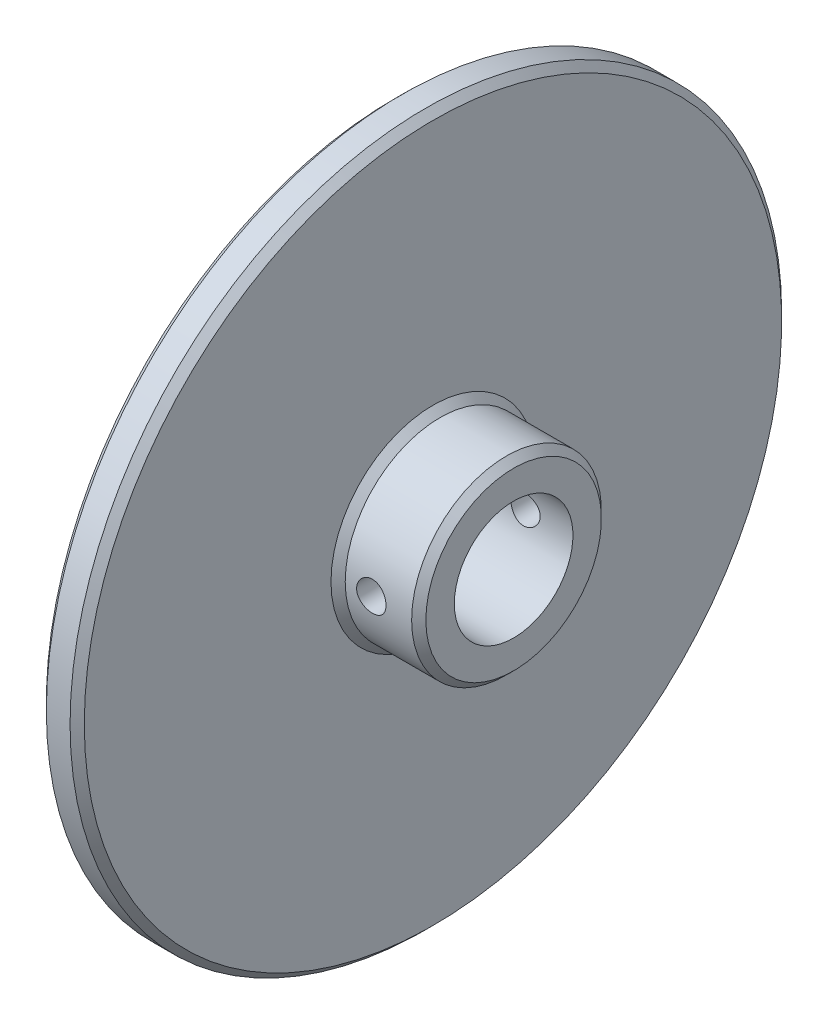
ISO-10303-21;
HEADER;
FILE_DESCRIPTION(('STEP AP214'),'2;1');
FILE_NAME('part.step','',(''),(''),'','','');
FILE_SCHEMA(('AUTOMOTIVE_DESIGN { 1 0 10303 214 1 1 1 1 }'));
ENDSEC;
DATA;
#1=APPLICATION_CONTEXT('core data for automotive mechanical design processes');
#2=APPLICATION_PROTOCOL_DEFINITION('international standard','automotive_design',2000,#1);
#3=PRODUCT_CONTEXT('',#1,'mechanical');
#4=PRODUCT('Part','Part','',(#3));
#5=PRODUCT_RELATED_PRODUCT_CATEGORY('part','',(#4));
#6=PRODUCT_DEFINITION_FORMATION('','',#4);
#7=PRODUCT_DEFINITION_CONTEXT('part definition',#1,'design');
#8=PRODUCT_DEFINITION('design','',#6,#7);
#9=PRODUCT_DEFINITION_SHAPE('','',#8);
#10=(LENGTH_UNIT() NAMED_UNIT(*) SI_UNIT(.MILLI.,.METRE.));
#11=(NAMED_UNIT(*) PLANE_ANGLE_UNIT() SI_UNIT($,.RADIAN.));
#12=(NAMED_UNIT(*) SI_UNIT($,.STERADIAN.) SOLID_ANGLE_UNIT());
#13=UNCERTAINTY_MEASURE_WITH_UNIT(LENGTH_MEASURE(1.E-05),#10,'distance_accuracy_value','');
#14=(GEOMETRIC_REPRESENTATION_CONTEXT(3) GLOBAL_UNCERTAINTY_ASSIGNED_CONTEXT((#13)) GLOBAL_UNIT_ASSIGNED_CONTEXT((#10,
#11,#12)) REPRESENTATION_CONTEXT('',''));
#15=CARTESIAN_POINT('',(0.,0.,0.));
#16=DIRECTION('',(0.,0.,1.));
#17=DIRECTION('',(1.,0.,0.));
#18=AXIS2_PLACEMENT_3D('',#15,#16,#17);
#19=CARTESIAN_POINT('',(0.,75.,0.));
#20=DIRECTION('',(1.,0.,0.));
#21=DIRECTION('',(0.,0.,-1.));
#22=AXIS2_PLACEMENT_3D('',#19,#20,#21);
#23=PLANE('',#22);
#24=CARTESIAN_POINT('',(0.,0.,0.));
#25=DIRECTION('',(1.,0.,0.));
#26=DIRECTION('',(0.,0.,-1.));
#27=AXIS2_PLACEMENT_3D('',#24,#25,#26);
#28=CIRCLE('',#27,14.);
#29=CARTESIAN_POINT('',(0.,0.,-14.));
#30=VERTEX_POINT('',#29);
#31=EDGE_CURVE('E131',#30,#30,#28,.T.);
#32=ORIENTED_EDGE('',*,*,#31,.T.);
#33=EDGE_LOOP('',(#32));
#34=FACE_BOUND('',#33,.T.);
#35=CARTESIAN_POINT('',(0.,0.,0.));
#36=DIRECTION('',(1.,0.,0.));
#37=DIRECTION('',(0.,0.,-1.));
#38=AXIS2_PLACEMENT_3D('',#35,#36,#37);
#39=CIRCLE('',#38,73.5000000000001);
#40=CARTESIAN_POINT('',(0.,0.,-73.5000000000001));
#41=VERTEX_POINT('',#40);
#42=EDGE_CURVE('E128',#41,#41,#39,.F.);
#43=ORIENTED_EDGE('',*,*,#42,.T.);
#44=EDGE_LOOP('',(#43));
#45=FACE_BOUND('',#44,.T.);
#46=ADVANCED_FACE('F30',(#34,#45),#23,.F.);
#47=CARTESIAN_POINT('',(-43.7052848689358,0.,0.));
#48=DIRECTION('',(-1.,0.,0.));
#49=DIRECTION('',(0.,0.,1.));
#50=AXIS2_PLACEMENT_3D('',#47,#48,#49);
#51=CYLINDRICAL_SURFACE('',#50,12.5);
#52=CARTESIAN_POINT('',(18.1,0.,12.5));
#53=CARTESIAN_POINT('',(18.0999951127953,0.171321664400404,12.4999970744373));
#54=CARTESIAN_POINT('',(18.0857500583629,0.342698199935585,12.4964427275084));
#55=CARTESIAN_POINT('',(18.0292297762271,0.68054256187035,12.4826080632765));
#56=CARTESIAN_POINT('',(17.9869383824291,0.847007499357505,12.4723238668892));
#57=CARTESIAN_POINT('',(17.8757635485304,1.17010085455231,12.4461687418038));
#58=CARTESIAN_POINT('',(17.8069117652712,1.32674072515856,12.4303044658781));
#59=CARTESIAN_POINT('',(17.6446812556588,1.62624649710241,12.394680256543));
#60=CARTESIAN_POINT('',(17.5513017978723,1.76911198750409,12.3749202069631));
#61=CARTESIAN_POINT('',(17.340664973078,2.03991290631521,12.3332026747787));
#62=CARTESIAN_POINT('',(17.223003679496,2.1675290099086,12.3112117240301));
#63=CARTESIAN_POINT('',(16.9680081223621,2.40143368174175,12.2677341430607));
#64=CARTESIAN_POINT('',(16.8306716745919,2.50771987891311,12.2462475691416));
#65=CARTESIAN_POINT('',(16.5377528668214,2.69744315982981,12.205874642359));
#66=CARTESIAN_POINT('',(16.3819335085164,2.78052420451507,12.1870308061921));
#67=CARTESIAN_POINT('',(16.0579973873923,2.91918958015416,12.1545645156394));
#68=CARTESIAN_POINT('',(15.8898825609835,2.97477823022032,12.1409412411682));
#69=CARTESIAN_POINT('',(15.5496358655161,3.05579378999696,12.1208023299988));
#70=CARTESIAN_POINT('',(15.3776487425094,3.08179427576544,12.114151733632));
#71=CARTESIAN_POINT('',(15.031635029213,3.10468184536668,12.1083071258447));
#72=CARTESIAN_POINT('',(14.8576087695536,3.10157358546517,12.1091119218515));
#73=CARTESIAN_POINT('',(14.5168436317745,3.06678979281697,12.1179657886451));
#74=CARTESIAN_POINT('',(14.3500299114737,3.03579655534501,12.1258418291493));
#75=CARTESIAN_POINT('',(14.0240467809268,2.9472104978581,12.1476751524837));
#76=CARTESIAN_POINT('',(13.864877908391,2.88961580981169,12.1616328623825));
#77=CARTESIAN_POINT('',(13.5568671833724,2.74887729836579,12.1942164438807));
#78=CARTESIAN_POINT('',(13.4081438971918,2.66548486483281,12.212887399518));
#79=CARTESIAN_POINT('',(13.1265566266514,2.47569199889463,12.2527681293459));
#80=CARTESIAN_POINT('',(12.9936953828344,2.36928759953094,12.2739783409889));
#81=CARTESIAN_POINT('',(12.7436923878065,2.13295176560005,12.3172772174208));
#82=CARTESIAN_POINT('',(12.6270959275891,2.00244425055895,12.3393738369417));
#83=CARTESIAN_POINT('',(12.4173412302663,1.72346462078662,12.3814190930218));
#84=CARTESIAN_POINT('',(12.3241836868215,1.57499197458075,12.4013676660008));
#85=CARTESIAN_POINT('',(12.1637555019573,1.26352628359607,12.436965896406));
#86=CARTESIAN_POINT('',(12.096572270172,1.10048644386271,12.4526009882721));
#87=CARTESIAN_POINT('',(11.99071814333,0.764953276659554,12.4777045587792));
#88=CARTESIAN_POINT('',(11.9520418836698,0.59246173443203,12.4871741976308));
#89=CARTESIAN_POINT('',(11.9051296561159,0.247584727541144,12.4987086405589));
#90=CARTESIAN_POINT('',(11.8961509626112,0.0753061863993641,12.5009540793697));
#91=CARTESIAN_POINT('',(11.9068532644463,-0.268291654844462,12.4983010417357));
#92=CARTESIAN_POINT('',(11.9265317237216,-0.439611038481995,12.4934031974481));
#93=CARTESIAN_POINT('',(11.9933772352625,-0.773854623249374,12.4771295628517));
#94=CARTESIAN_POINT('',(12.0401401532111,-0.936864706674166,12.4658490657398));
#95=CARTESIAN_POINT('',(12.1593664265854,-1.25271883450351,12.4380808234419));
#96=CARTESIAN_POINT('',(12.231832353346,-1.40556185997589,12.4215925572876));
#97=CARTESIAN_POINT('',(12.4018542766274,-1.69970617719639,12.3848041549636));
#98=CARTESIAN_POINT('',(12.4998276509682,-1.84075831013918,12.3644422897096));
#99=CARTESIAN_POINT('',(12.7175488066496,-2.10468362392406,12.3222644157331));
#100=CARTESIAN_POINT('',(12.8373002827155,-2.22755371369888,12.3004481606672));
#101=CARTESIAN_POINT('',(13.0986244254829,-2.45467959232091,12.2571718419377));
#102=CARTESIAN_POINT('',(13.2406538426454,-2.55841478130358,12.2357330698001));
#103=CARTESIAN_POINT('',(13.5405439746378,-2.74057686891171,12.1962272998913));
#104=CARTESIAN_POINT('',(13.698403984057,-2.8190048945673,12.1781601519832));
#105=CARTESIAN_POINT('',(14.0246239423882,-2.9477445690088,12.1476409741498));
#106=CARTESIAN_POINT('',(14.1929148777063,-2.99822281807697,12.1351557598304));
#107=CARTESIAN_POINT('',(14.5359507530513,-3.07007327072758,12.1171798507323));
#108=CARTESIAN_POINT('',(14.710694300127,-3.09145171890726,12.1116876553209));
#109=CARTESIAN_POINT('',(15.0563809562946,-3.10417336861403,12.108432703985));
#110=CARTESIAN_POINT('',(15.2272919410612,-3.09634814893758,12.1104559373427));
#111=CARTESIAN_POINT('',(15.5652759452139,-3.05278480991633,12.1215098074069));
#112=CARTESIAN_POINT('',(15.7323490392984,-3.01704723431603,12.1305403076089));
#113=CARTESIAN_POINT('',(16.0570269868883,-2.91912445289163,12.1544728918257));
#114=CARTESIAN_POINT('',(16.2146808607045,-2.85709286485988,12.1693408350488));
#115=CARTESIAN_POINT('',(16.5174551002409,-2.70846488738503,12.2032783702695));
#116=CARTESIAN_POINT('',(16.66257375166,-2.62186514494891,12.2223485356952));
#117=CARTESIAN_POINT('',(16.9401821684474,-2.42394187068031,12.2631540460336));
#118=CARTESIAN_POINT('',(17.072251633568,-2.31204024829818,12.2849452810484));
#119=CARTESIAN_POINT('',(17.3160088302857,-2.06781935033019,12.3284012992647));
#120=CARTESIAN_POINT('',(17.4276917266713,-1.93549524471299,12.3500660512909));
#121=CARTESIAN_POINT('',(17.6294356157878,-1.65135189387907,12.3912866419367));
#122=CARTESIAN_POINT('',(17.7190778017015,-1.49922839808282,12.4107982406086));
#123=CARTESIAN_POINT('',(17.8713737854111,-1.18160190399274,12.4450491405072));
#124=CARTESIAN_POINT('',(17.9340471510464,-1.01610871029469,12.4597918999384));
#125=CARTESIAN_POINT('',(18.0211947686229,-0.709064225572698,12.4806334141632));
#126=CARTESIAN_POINT('',(18.0506833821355,-0.568990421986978,12.4878463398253));
#127=CARTESIAN_POINT('',(18.0900873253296,-0.285957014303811,12.4975306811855));
#128=CARTESIAN_POINT('',(18.1000040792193,-0.142997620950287,12.5000024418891));
#129=CARTESIAN_POINT('',(18.1,0.,12.5));
#130=B_SPLINE_CURVE_WITH_KNOTS('',3,(#52,#53,#54,#55,#56,#57,#58,#59,#60,#61,#62,#63,#64,#65,
#66,#67,#68,#69,#70,#71,#72,#73,#74,#75,#76,#77,#78,#79,#80,#81,#82,#83,#84,#85,#86,#87,#88,#89,
#90,#91,#92,#93,#94,#95,#96,#97,#98,#99,#100,#101,#102,#103,#104,#105,#106,#107,#108,#109,#110,
#111,#112,#113,#114,#115,#116,#117,#118,#119,#120,#121,#122,#123,#124,#125,#126,#127,#128,#129),
.UNSPECIFIED.,.T.,.F.,(4,2,2,2,2,2,2,2,2,2,2,2,2,2,2,2,2,2,2,2,2,2,2,2,2,2,2,2,2,2,2,2,2,2,2,2,
2,2,4),(0.,0.513441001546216,1.02717821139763,1.54030498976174,2.05344707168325,
2.57593534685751,3.09848167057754,3.628652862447,4.15874073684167,4.67836762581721,
5.1979113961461,5.70507856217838,6.2122813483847,6.72453284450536,7.23687271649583,
7.7635798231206,8.29030251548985,8.81878263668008,9.34716328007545,9.86222518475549,
10.3772415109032,10.8847641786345,11.3923376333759,11.9088047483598,12.4253595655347,
12.9543766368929,13.4833701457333,14.0091755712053,14.5348681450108,15.0457072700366,
15.5565364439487,16.0644214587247,16.5723758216,17.093381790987,17.6145111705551,
18.1448871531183,18.6748776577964,19.103464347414,19.532019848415),.UNSPECIFIED.);
#131=CARTESIAN_POINT('',(18.1,0.,12.5));
#132=VERTEX_POINT('',#131);
#133=EDGE_CURVE('E75',#132,#132,#130,.T.);
#134=ORIENTED_EDGE('',*,*,#133,.T.);
#135=EDGE_LOOP('',(#134));
#136=FACE_BOUND('',#135,.T.);
#137=CARTESIAN_POINT('',(18.1,0.,-12.5));
#138=CARTESIAN_POINT('',(18.0999951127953,-0.171321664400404,-12.4999970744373));
#139=CARTESIAN_POINT('',(18.0857500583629,-0.342698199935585,-12.4964427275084));
#140=CARTESIAN_POINT('',(18.0292297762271,-0.68054256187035,-12.4826080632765));
#141=CARTESIAN_POINT('',(17.9869383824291,-0.847007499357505,-12.4723238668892));
#142=CARTESIAN_POINT('',(17.8757635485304,-1.17010085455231,-12.4461687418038));
#143=CARTESIAN_POINT('',(17.8069117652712,-1.32674072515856,-12.4303044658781));
#144=CARTESIAN_POINT('',(17.6446812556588,-1.62624649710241,-12.394680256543));
#145=CARTESIAN_POINT('',(17.5513017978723,-1.76911198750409,-12.3749202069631));
#146=CARTESIAN_POINT('',(17.340664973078,-2.03991290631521,-12.3332026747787));
#147=CARTESIAN_POINT('',(17.223003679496,-2.1675290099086,-12.3112117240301));
#148=CARTESIAN_POINT('',(16.9680081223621,-2.40143368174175,-12.2677341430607));
#149=CARTESIAN_POINT('',(16.8306716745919,-2.50771987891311,-12.2462475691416));
#150=CARTESIAN_POINT('',(16.5377528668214,-2.69744315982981,-12.205874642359));
#151=CARTESIAN_POINT('',(16.3819335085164,-2.78052420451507,-12.1870308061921));
#152=CARTESIAN_POINT('',(16.0579973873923,-2.91918958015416,-12.1545645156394));
#153=CARTESIAN_POINT('',(15.8898825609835,-2.97477823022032,-12.1409412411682));
#154=CARTESIAN_POINT('',(15.5496358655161,-3.05579378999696,-12.1208023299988));
#155=CARTESIAN_POINT('',(15.3776487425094,-3.08179427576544,-12.114151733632));
#156=CARTESIAN_POINT('',(15.031635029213,-3.10468184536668,-12.1083071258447));
#157=CARTESIAN_POINT('',(14.8576087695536,-3.10157358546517,-12.1091119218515));
#158=CARTESIAN_POINT('',(14.5168436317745,-3.06678979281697,-12.1179657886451));
#159=CARTESIAN_POINT('',(14.3500299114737,-3.03579655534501,-12.1258418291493));
#160=CARTESIAN_POINT('',(14.0240467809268,-2.9472104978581,-12.1476751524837));
#161=CARTESIAN_POINT('',(13.864877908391,-2.88961580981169,-12.1616328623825));
#162=CARTESIAN_POINT('',(13.5568671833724,-2.74887729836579,-12.1942164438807));
#163=CARTESIAN_POINT('',(13.4081438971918,-2.66548486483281,-12.212887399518));
#164=CARTESIAN_POINT('',(13.1265566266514,-2.47569199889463,-12.2527681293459));
#165=CARTESIAN_POINT('',(12.9936953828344,-2.36928759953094,-12.2739783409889));
#166=CARTESIAN_POINT('',(12.7436923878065,-2.13295176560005,-12.3172772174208));
#167=CARTESIAN_POINT('',(12.6270959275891,-2.00244425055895,-12.3393738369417));
#168=CARTESIAN_POINT('',(12.4173412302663,-1.72346462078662,-12.3814190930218));
#169=CARTESIAN_POINT('',(12.3241836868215,-1.57499197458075,-12.4013676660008));
#170=CARTESIAN_POINT('',(12.1637555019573,-1.26352628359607,-12.436965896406));
#171=CARTESIAN_POINT('',(12.096572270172,-1.10048644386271,-12.4526009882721));
#172=CARTESIAN_POINT('',(11.99071814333,-0.764953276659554,-12.4777045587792));
#173=CARTESIAN_POINT('',(11.9520418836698,-0.59246173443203,-12.4871741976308));
#174=CARTESIAN_POINT('',(11.9051296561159,-0.247584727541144,-12.4987086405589));
#175=CARTESIAN_POINT('',(11.8961509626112,-0.0753061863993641,-12.5009540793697));
#176=CARTESIAN_POINT('',(11.9068532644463,0.268291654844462,-12.4983010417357));
#177=CARTESIAN_POINT('',(11.9265317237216,0.439611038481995,-12.4934031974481));
#178=CARTESIAN_POINT('',(11.9933772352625,0.773854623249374,-12.4771295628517));
#179=CARTESIAN_POINT('',(12.0401401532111,0.936864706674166,-12.4658490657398));
#180=CARTESIAN_POINT('',(12.1593664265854,1.25271883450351,-12.4380808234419));
#181=CARTESIAN_POINT('',(12.231832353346,1.40556185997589,-12.4215925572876));
#182=CARTESIAN_POINT('',(12.4018542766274,1.69970617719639,-12.3848041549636));
#183=CARTESIAN_POINT('',(12.4998276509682,1.84075831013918,-12.3644422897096));
#184=CARTESIAN_POINT('',(12.7175488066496,2.10468362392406,-12.3222644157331));
#185=CARTESIAN_POINT('',(12.8373002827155,2.22755371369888,-12.3004481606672));
#186=CARTESIAN_POINT('',(13.0986244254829,2.45467959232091,-12.2571718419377));
#187=CARTESIAN_POINT('',(13.2406538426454,2.55841478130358,-12.2357330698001));
#188=CARTESIAN_POINT('',(13.5405439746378,2.74057686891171,-12.1962272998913));
#189=CARTESIAN_POINT('',(13.698403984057,2.8190048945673,-12.1781601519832));
#190=CARTESIAN_POINT('',(14.0246239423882,2.9477445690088,-12.1476409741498));
#191=CARTESIAN_POINT('',(14.1929148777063,2.99822281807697,-12.1351557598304));
#192=CARTESIAN_POINT('',(14.5359507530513,3.07007327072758,-12.1171798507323));
#193=CARTESIAN_POINT('',(14.710694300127,3.09145171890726,-12.1116876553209));
#194=CARTESIAN_POINT('',(15.0563809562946,3.10417336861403,-12.108432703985));
#195=CARTESIAN_POINT('',(15.2272919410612,3.09634814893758,-12.1104559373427));
#196=CARTESIAN_POINT('',(15.5652759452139,3.05278480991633,-12.1215098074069));
#197=CARTESIAN_POINT('',(15.7323490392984,3.01704723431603,-12.1305403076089));
#198=CARTESIAN_POINT('',(16.0570269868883,2.91912445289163,-12.1544728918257));
#199=CARTESIAN_POINT('',(16.2146808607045,2.85709286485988,-12.1693408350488));
#200=CARTESIAN_POINT('',(16.5174551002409,2.70846488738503,-12.2032783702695));
#201=CARTESIAN_POINT('',(16.66257375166,2.62186514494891,-12.2223485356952));
#202=CARTESIAN_POINT('',(16.9401821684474,2.42394187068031,-12.2631540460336));
#203=CARTESIAN_POINT('',(17.072251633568,2.31204024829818,-12.2849452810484));
#204=CARTESIAN_POINT('',(17.3160088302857,2.06781935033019,-12.3284012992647));
#205=CARTESIAN_POINT('',(17.4276917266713,1.93549524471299,-12.3500660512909));
#206=CARTESIAN_POINT('',(17.6294356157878,1.65135189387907,-12.3912866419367));
#207=CARTESIAN_POINT('',(17.7190778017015,1.49922839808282,-12.4107982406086));
#208=CARTESIAN_POINT('',(17.8713737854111,1.18160190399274,-12.4450491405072));
#209=CARTESIAN_POINT('',(17.9340471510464,1.01610871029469,-12.4597918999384));
#210=CARTESIAN_POINT('',(18.0211947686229,0.709064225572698,-12.4806334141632));
#211=CARTESIAN_POINT('',(18.0506833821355,0.568990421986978,-12.4878463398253));
#212=CARTESIAN_POINT('',(18.0900873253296,0.285957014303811,-12.4975306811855));
#213=CARTESIAN_POINT('',(18.1000040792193,0.142997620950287,-12.5000024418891));
#214=CARTESIAN_POINT('',(18.1,0.,-12.5));
#215=B_SPLINE_CURVE_WITH_KNOTS('',3,(#137,#138,#139,#140,#141,#142,#143,#144,#145,#146,#147,
#148,#149,#150,#151,#152,#153,#154,#155,#156,#157,#158,#159,#160,#161,#162,#163,#164,#165,#166,
#167,#168,#169,#170,#171,#172,#173,#174,#175,#176,#177,#178,#179,#180,#181,#182,#183,#184,#185,
#186,#187,#188,#189,#190,#191,#192,#193,#194,#195,#196,#197,#198,#199,#200,#201,#202,#203,#204,
#205,#206,#207,#208,#209,#210,#211,#212,#213,#214),.UNSPECIFIED.,.T.,.F.,(4,2,2,2,2,2,2,2,2,2,2,
2,2,2,2,2,2,2,2,2,2,2,2,2,2,2,2,2,2,2,2,2,2,2,2,2,2,2,4),(0.,0.513441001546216,1.02717821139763,
1.54030498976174,2.05344707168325,2.57593534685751,3.09848167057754,3.628652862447,
4.15874073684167,4.67836762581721,5.1979113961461,5.70507856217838,6.2122813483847,
6.72453284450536,7.23687271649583,7.7635798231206,8.29030251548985,8.81878263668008,
9.34716328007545,9.86222518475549,10.3772415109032,10.8847641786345,11.3923376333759,
11.9088047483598,12.4253595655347,12.9543766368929,13.4833701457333,14.0091755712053,
14.5348681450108,15.0457072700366,15.5565364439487,16.0644214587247,16.5723758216,
17.093381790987,17.6145111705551,18.1448871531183,18.6748776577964,19.103464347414,
19.532019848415),.UNSPECIFIED.);
#216=CARTESIAN_POINT('',(18.1,0.,-12.5));
#217=VERTEX_POINT('',#216);
#218=EDGE_CURVE('E70',#217,#217,#215,.T.);
#219=ORIENTED_EDGE('',*,*,#218,.T.);
#220=EDGE_LOOP('',(#219));
#221=FACE_BOUND('',#220,.T.);
#222=CARTESIAN_POINT('',(1.5,0.,0.));
#223=DIRECTION('',(1.,0.,0.));
#224=DIRECTION('',(0.,0.,-1.));
#225=AXIS2_PLACEMENT_3D('',#222,#223,#224);
#226=CIRCLE('',#225,12.5);
#227=CARTESIAN_POINT('',(1.5,0.,-12.5));
#228=VERTEX_POINT('',#227);
#229=EDGE_CURVE('E125',#228,#228,#226,.F.);
#230=ORIENTED_EDGE('',*,*,#229,.T.);
#231=EDGE_LOOP('',(#230));
#232=FACE_BOUND('',#231,.T.);
#233=CARTESIAN_POINT('',(25.,0.,0.));
#234=DIRECTION('',(-1.,0.,0.));
#235=DIRECTION('',(0.,0.,1.));
#236=AXIS2_PLACEMENT_3D('',#233,#234,#235);
#237=CIRCLE('',#236,12.5);
#238=CARTESIAN_POINT('',(25.,0.,12.5));
#239=VERTEX_POINT('',#238);
#240=EDGE_CURVE('E113',#239,#239,#237,.T.);
#241=ORIENTED_EDGE('',*,*,#240,.F.);
#242=EDGE_LOOP('',(#241));
#243=FACE_BOUND('',#242,.T.);
#244=ADVANCED_FACE('F79',(#136,#221,#232,#243),#51,.F.);
#245=CARTESIAN_POINT('',(25.,12.5,0.));
#246=DIRECTION('',(-1.,0.,0.));
#247=DIRECTION('',(0.,0.,1.));
#248=AXIS2_PLACEMENT_3D('',#245,#246,#247);
#249=PLANE('',#248);
#250=CARTESIAN_POINT('',(25.,0.,0.));
#251=DIRECTION('',(-1.,0.,0.));
#252=DIRECTION('',(0.,0.,1.));
#253=AXIS2_PLACEMENT_3D('',#250,#251,#252);
#254=CIRCLE('',#253,18.5);
#255=CARTESIAN_POINT('',(25.,0.,18.5));
#256=VERTEX_POINT('',#255);
#257=EDGE_CURVE('E47',#256,#256,#254,.F.);
#258=ORIENTED_EDGE('',*,*,#257,.T.);
#259=EDGE_LOOP('',(#258));
#260=FACE_BOUND('',#259,.T.);
#261=ORIENTED_EDGE('',*,*,#240,.T.);
#262=EDGE_LOOP('',(#261));
#263=FACE_BOUND('',#262,.T.);
#264=ADVANCED_FACE('F83',(#260,#263),#249,.F.);
#265=CARTESIAN_POINT('',(-43.7052848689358,0.,0.));
#266=DIRECTION('',(-1.,0.,0.));
#267=DIRECTION('',(0.,0.,1.));
#268=AXIS2_PLACEMENT_3D('',#265,#266,#267);
#269=CYLINDRICAL_SURFACE('',#268,20.);
#270=CARTESIAN_POINT('',(18.1,0.,20.));
#271=CARTESIAN_POINT('',(18.0999929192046,-0.173016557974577,19.9999971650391));
#272=CARTESIAN_POINT('',(18.0854665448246,-0.34613178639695,19.9977314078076));
#273=CARTESIAN_POINT('',(18.0277622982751,-0.687518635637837,19.9889109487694));
#274=CARTESIAN_POINT('',(17.9845569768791,-0.855785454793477,19.9823521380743));
#275=CARTESIAN_POINT('',(17.8708208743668,-1.18248593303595,19.9656822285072));
#276=CARTESIAN_POINT('',(17.8003112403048,-1.34092709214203,19.9555738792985));
#277=CARTESIAN_POINT('',(17.634020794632,-1.64370610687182,19.9329202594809));
#278=CARTESIAN_POINT('',(17.5382433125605,-1.78804581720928,19.9203753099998));
#279=CARTESIAN_POINT('',(17.3232873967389,-2.05974845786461,19.8941255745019));
#280=CARTESIAN_POINT('',(17.2039401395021,-2.18697707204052,19.8804128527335));
#281=CARTESIAN_POINT('',(16.9455958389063,-2.4196867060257,19.85343479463));
#282=CARTESIAN_POINT('',(16.8065976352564,-2.52516644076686,19.8401694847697));
#283=CARTESIAN_POINT('',(16.5119886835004,-2.71191152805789,19.8155112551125));
#284=CARTESIAN_POINT('',(16.3562940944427,-2.79304608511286,19.8041285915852));
#285=CARTESIAN_POINT('',(16.0332811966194,-2.92796168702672,19.7846333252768));
#286=CARTESIAN_POINT('',(15.8659635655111,-2.98174432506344,19.7765205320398));
#287=CARTESIAN_POINT('',(15.5258700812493,-3.06001047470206,19.7645618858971));
#288=CARTESIAN_POINT('',(15.353148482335,-3.08472451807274,19.7606824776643));
#289=CARTESIAN_POINT('',(15.0059695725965,-3.1048662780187,19.7575280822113));
#290=CARTESIAN_POINT('',(14.831512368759,-3.10029578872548,19.758252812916));
#291=CARTESIAN_POINT('',(14.4874478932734,-3.06218643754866,19.7641941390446));
#292=CARTESIAN_POINT('',(14.3178113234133,-3.02890496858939,19.7693708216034));
#293=CARTESIAN_POINT('',(13.9865595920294,-2.93472161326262,19.783570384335));
#294=CARTESIAN_POINT('',(13.8249446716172,-2.87381889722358,19.7925933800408));
#295=CARTESIAN_POINT('',(13.5135444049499,-2.72585610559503,19.8135127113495));
#296=CARTESIAN_POINT('',(13.3638113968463,-2.63868762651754,19.8254209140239));
#297=CARTESIAN_POINT('',(13.0810000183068,-2.44074483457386,19.8507604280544));
#298=CARTESIAN_POINT('',(12.9479228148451,-2.32996886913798,19.8641918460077));
#299=CARTESIAN_POINT('',(12.7007093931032,-2.0865457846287,19.8912404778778));
#300=CARTESIAN_POINT('',(12.5867908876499,-1.95367749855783,19.9048581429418));
#301=CARTESIAN_POINT('',(12.3828354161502,-1.67059352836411,19.9306117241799));
#302=CARTESIAN_POINT('',(12.2927985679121,-1.52037775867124,19.9427476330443));
#303=CARTESIAN_POINT('',(12.1391485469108,-1.20666955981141,19.9641842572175));
#304=CARTESIAN_POINT('',(12.0755528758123,-1.04316842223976,19.973483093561));
#305=CARTESIAN_POINT('',(11.9767834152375,-0.707630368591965,19.9881823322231));
#306=CARTESIAN_POINT('',(11.9416075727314,-0.535594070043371,19.9935830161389));
#307=CARTESIAN_POINT('',(11.9009674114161,-0.189747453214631,19.999839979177));
#308=CARTESIAN_POINT('',(11.8952039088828,-0.0159730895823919,20.0007420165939));
#309=CARTESIAN_POINT('',(11.9127568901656,0.330059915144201,19.9980248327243));
#310=CARTESIAN_POINT('',(11.9360724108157,0.502318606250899,19.9944057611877));
#311=CARTESIAN_POINT('',(12.0108727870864,0.839519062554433,19.9830813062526));
#312=CARTESIAN_POINT('',(12.0622111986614,1.00449408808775,19.9753971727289));
#313=CARTESIAN_POINT('',(12.191445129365,1.32349525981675,19.9568011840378));
#314=CARTESIAN_POINT('',(12.2693419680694,1.4775208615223,19.9458891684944));
#315=CARTESIAN_POINT('',(12.4501786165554,1.7715619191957,19.9219357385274));
#316=CARTESIAN_POINT('',(12.553307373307,1.91145985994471,19.9088785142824));
#317=CARTESIAN_POINT('',(12.7814182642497,2.17206987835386,19.8821353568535));
#318=CARTESIAN_POINT('',(12.9064017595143,2.29278076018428,19.8684493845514));
#319=CARTESIAN_POINT('',(13.1760091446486,2.5126846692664,19.8418452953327));
#320=CARTESIAN_POINT('',(13.320797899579,2.61167667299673,19.8289350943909));
#321=CARTESIAN_POINT('',(13.6251245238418,2.78393359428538,19.805486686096));
#322=CARTESIAN_POINT('',(13.7846619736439,2.85719924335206,19.7949484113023));
#323=CARTESIAN_POINT('',(14.1133687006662,2.97561529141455,19.7774949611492));
#324=CARTESIAN_POINT('',(14.2824997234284,3.02086981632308,19.7705663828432));
#325=CARTESIAN_POINT('',(14.6260775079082,3.08230938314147,19.7610817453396));
#326=CARTESIAN_POINT('',(14.8005238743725,3.09849658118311,19.7585253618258));
#327=CARTESIAN_POINT('',(15.1477757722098,3.10128813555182,19.7580872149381));
#328=CARTESIAN_POINT('',(15.32057878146,3.08820865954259,19.7601554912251));
#329=CARTESIAN_POINT('',(15.6614952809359,3.03351744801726,19.7686247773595));
#330=CARTESIAN_POINT('',(15.8296087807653,2.99190577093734,19.7750257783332));
#331=CARTESIAN_POINT('',(16.1562764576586,2.88144589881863,19.791421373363));
#332=CARTESIAN_POINT('',(16.3148387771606,2.81262129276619,19.801412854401));
#333=CARTESIAN_POINT('',(16.6182171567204,2.64972096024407,19.8238671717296));
#334=CARTESIAN_POINT('',(16.7630326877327,2.55564426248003,19.836330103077));
#335=CARTESIAN_POINT('',(17.0364105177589,2.34376738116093,19.862483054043));
#336=CARTESIAN_POINT('',(17.1647906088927,2.22573346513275,19.876184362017));
#337=CARTESIAN_POINT('',(17.40003263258,1.96978661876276,19.903177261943));
#338=CARTESIAN_POINT('',(17.5068895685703,1.8318690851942,19.9164687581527));
#339=CARTESIAN_POINT('',(17.6966194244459,1.53910930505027,19.9412344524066));
#340=CARTESIAN_POINT('',(17.7793471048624,1.38417199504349,19.9526974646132));
#341=CARTESIAN_POINT('',(17.9174790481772,1.06249346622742,19.9724052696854));
#342=CARTESIAN_POINT('',(17.9729112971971,0.895764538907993,19.9806533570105));
#343=CARTESIAN_POINT('',(18.0424599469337,0.606929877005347,19.9911430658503));
#344=CARTESIAN_POINT('',(18.0640040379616,0.486597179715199,19.9944471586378));
#345=CARTESIAN_POINT('',(18.0927764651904,0.244192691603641,19.9988766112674));
#346=CARTESIAN_POINT('',(18.1000049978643,0.122120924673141,20.000002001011));
#347=CARTESIAN_POINT('',(18.1,0.,20.));
#348=B_SPLINE_CURVE_WITH_KNOTS('',3,(#270,#271,#272,#273,#274,#275,#276,#277,#278,#279,#280,
#281,#282,#283,#284,#285,#286,#287,#288,#289,#290,#291,#292,#293,#294,#295,#296,#297,#298,#299,
#300,#301,#302,#303,#304,#305,#306,#307,#308,#309,#310,#311,#312,#313,#314,#315,#316,#317,#318,
#319,#320,#321,#322,#323,#324,#325,#326,#327,#328,#329,#330,#331,#332,#333,#334,#335,#336,#337,
#338,#339,#340,#341,#342,#343,#344,#345,#346,#347),.UNSPECIFIED.,.T.,.F.,(4,2,2,2,2,2,2,2,2,2,2,
2,2,2,2,2,2,2,2,2,2,2,2,2,2,2,2,2,2,2,2,2,2,2,2,2,2,2,4),(0.,0.518603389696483,1.03770386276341,
1.55640309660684,2.07503401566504,2.59752406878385,3.12004498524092,3.64532487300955,
4.17057416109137,4.69162919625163,5.21265230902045,5.72905244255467,6.24546808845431,
6.76404496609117,7.28265815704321,7.80681594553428,8.33097631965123,8.85548309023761,
9.3799519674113,9.89907513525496,10.4181811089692,10.9345999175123,11.4510443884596,
11.9714813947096,12.4919508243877,13.0170514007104,13.5421370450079,14.0652588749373,
14.5883418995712,15.105801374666,15.6232597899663,16.1402706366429,16.6573013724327,
17.1796423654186,17.7021044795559,18.2276494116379,18.7526543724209,19.1187071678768,
19.4847549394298),.UNSPECIFIED.);
#349=CARTESIAN_POINT('',(18.1,0.,20.));
#350=VERTEX_POINT('',#349);
#351=EDGE_CURVE('E34',#350,#350,#348,.T.);
#352=ORIENTED_EDGE('',*,*,#351,.T.);
#353=EDGE_LOOP('',(#352));
#354=FACE_BOUND('',#353,.T.);
#355=CARTESIAN_POINT('',(18.1,0.,-20.));
#356=CARTESIAN_POINT('',(18.0999929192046,0.173016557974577,-19.9999971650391));
#357=CARTESIAN_POINT('',(18.0854665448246,0.34613178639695,-19.9977314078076));
#358=CARTESIAN_POINT('',(18.0277622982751,0.687518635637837,-19.9889109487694));
#359=CARTESIAN_POINT('',(17.9845569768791,0.855785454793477,-19.9823521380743));
#360=CARTESIAN_POINT('',(17.8708208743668,1.18248593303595,-19.9656822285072));
#361=CARTESIAN_POINT('',(17.8003112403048,1.34092709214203,-19.9555738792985));
#362=CARTESIAN_POINT('',(17.634020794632,1.64370610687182,-19.9329202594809));
#363=CARTESIAN_POINT('',(17.5382433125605,1.78804581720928,-19.9203753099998));
#364=CARTESIAN_POINT('',(17.3232873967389,2.05974845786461,-19.8941255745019));
#365=CARTESIAN_POINT('',(17.2039401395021,2.18697707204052,-19.8804128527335));
#366=CARTESIAN_POINT('',(16.9455958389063,2.4196867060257,-19.85343479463));
#367=CARTESIAN_POINT('',(16.8065976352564,2.52516644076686,-19.8401694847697));
#368=CARTESIAN_POINT('',(16.5119886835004,2.71191152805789,-19.8155112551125));
#369=CARTESIAN_POINT('',(16.3562940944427,2.79304608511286,-19.8041285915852));
#370=CARTESIAN_POINT('',(16.0332811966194,2.92796168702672,-19.7846333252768));
#371=CARTESIAN_POINT('',(15.8659635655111,2.98174432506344,-19.7765205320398));
#372=CARTESIAN_POINT('',(15.5258700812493,3.06001047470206,-19.7645618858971));
#373=CARTESIAN_POINT('',(15.353148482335,3.08472451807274,-19.7606824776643));
#374=CARTESIAN_POINT('',(15.0059695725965,3.1048662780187,-19.7575280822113));
#375=CARTESIAN_POINT('',(14.831512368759,3.10029578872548,-19.758252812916));
#376=CARTESIAN_POINT('',(14.4874478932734,3.06218643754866,-19.7641941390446));
#377=CARTESIAN_POINT('',(14.3178113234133,3.02890496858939,-19.7693708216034));
#378=CARTESIAN_POINT('',(13.9865595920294,2.93472161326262,-19.783570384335));
#379=CARTESIAN_POINT('',(13.8249446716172,2.87381889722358,-19.7925933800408));
#380=CARTESIAN_POINT('',(13.5135444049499,2.72585610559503,-19.8135127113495));
#381=CARTESIAN_POINT('',(13.3638113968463,2.63868762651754,-19.8254209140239));
#382=CARTESIAN_POINT('',(13.0810000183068,2.44074483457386,-19.8507604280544));
#383=CARTESIAN_POINT('',(12.9479228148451,2.32996886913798,-19.8641918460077));
#384=CARTESIAN_POINT('',(12.7007093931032,2.0865457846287,-19.8912404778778));
#385=CARTESIAN_POINT('',(12.5867908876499,1.95367749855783,-19.9048581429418));
#386=CARTESIAN_POINT('',(12.3828354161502,1.67059352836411,-19.9306117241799));
#387=CARTESIAN_POINT('',(12.2927985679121,1.52037775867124,-19.9427476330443));
#388=CARTESIAN_POINT('',(12.1391485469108,1.20666955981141,-19.9641842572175));
#389=CARTESIAN_POINT('',(12.0755528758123,1.04316842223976,-19.973483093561));
#390=CARTESIAN_POINT('',(11.9767834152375,0.707630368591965,-19.9881823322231));
#391=CARTESIAN_POINT('',(11.9416075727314,0.535594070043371,-19.9935830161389));
#392=CARTESIAN_POINT('',(11.9009674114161,0.189747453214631,-19.999839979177));
#393=CARTESIAN_POINT('',(11.8952039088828,0.0159730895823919,-20.0007420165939));
#394=CARTESIAN_POINT('',(11.9127568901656,-0.330059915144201,-19.9980248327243));
#395=CARTESIAN_POINT('',(11.9360724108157,-0.502318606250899,-19.9944057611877));
#396=CARTESIAN_POINT('',(12.0108727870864,-0.839519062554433,-19.9830813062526));
#397=CARTESIAN_POINT('',(12.0622111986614,-1.00449408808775,-19.9753971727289));
#398=CARTESIAN_POINT('',(12.191445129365,-1.32349525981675,-19.9568011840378));
#399=CARTESIAN_POINT('',(12.2693419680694,-1.4775208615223,-19.9458891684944));
#400=CARTESIAN_POINT('',(12.4501786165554,-1.7715619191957,-19.9219357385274));
#401=CARTESIAN_POINT('',(12.553307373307,-1.91145985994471,-19.9088785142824));
#402=CARTESIAN_POINT('',(12.7814182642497,-2.17206987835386,-19.8821353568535));
#403=CARTESIAN_POINT('',(12.9064017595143,-2.29278076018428,-19.8684493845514));
#404=CARTESIAN_POINT('',(13.1760091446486,-2.5126846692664,-19.8418452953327));
#405=CARTESIAN_POINT('',(13.320797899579,-2.61167667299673,-19.8289350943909));
#406=CARTESIAN_POINT('',(13.6251245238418,-2.78393359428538,-19.805486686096));
#407=CARTESIAN_POINT('',(13.7846619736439,-2.85719924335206,-19.7949484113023));
#408=CARTESIAN_POINT('',(14.1133687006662,-2.97561529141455,-19.7774949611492));
#409=CARTESIAN_POINT('',(14.2824997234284,-3.02086981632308,-19.7705663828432));
#410=CARTESIAN_POINT('',(14.6260775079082,-3.08230938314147,-19.7610817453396));
#411=CARTESIAN_POINT('',(14.8005238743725,-3.09849658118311,-19.7585253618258));
#412=CARTESIAN_POINT('',(15.1477757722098,-3.10128813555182,-19.7580872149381));
#413=CARTESIAN_POINT('',(15.32057878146,-3.08820865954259,-19.7601554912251));
#414=CARTESIAN_POINT('',(15.6614952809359,-3.03351744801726,-19.7686247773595));
#415=CARTESIAN_POINT('',(15.8296087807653,-2.99190577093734,-19.7750257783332));
#416=CARTESIAN_POINT('',(16.1562764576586,-2.88144589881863,-19.791421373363));
#417=CARTESIAN_POINT('',(16.3148387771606,-2.81262129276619,-19.801412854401));
#418=CARTESIAN_POINT('',(16.6182171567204,-2.64972096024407,-19.8238671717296));
#419=CARTESIAN_POINT('',(16.7630326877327,-2.55564426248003,-19.836330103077));
#420=CARTESIAN_POINT('',(17.0364105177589,-2.34376738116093,-19.862483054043));
#421=CARTESIAN_POINT('',(17.1647906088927,-2.22573346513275,-19.876184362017));
#422=CARTESIAN_POINT('',(17.40003263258,-1.96978661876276,-19.903177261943));
#423=CARTESIAN_POINT('',(17.5068895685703,-1.8318690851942,-19.9164687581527));
#424=CARTESIAN_POINT('',(17.6966194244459,-1.53910930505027,-19.9412344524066));
#425=CARTESIAN_POINT('',(17.7793471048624,-1.38417199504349,-19.9526974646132));
#426=CARTESIAN_POINT('',(17.9174790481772,-1.06249346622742,-19.9724052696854));
#427=CARTESIAN_POINT('',(17.9729112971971,-0.895764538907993,-19.9806533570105));
#428=CARTESIAN_POINT('',(18.0424599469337,-0.606929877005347,-19.9911430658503));
#429=CARTESIAN_POINT('',(18.0640040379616,-0.486597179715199,-19.9944471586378));
#430=CARTESIAN_POINT('',(18.0927764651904,-0.244192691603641,-19.9988766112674));
#431=CARTESIAN_POINT('',(18.1000049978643,-0.122120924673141,-20.000002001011));
#432=CARTESIAN_POINT('',(18.1,0.,-20.));
#433=B_SPLINE_CURVE_WITH_KNOTS('',3,(#355,#356,#357,#358,#359,#360,#361,#362,#363,#364,#365,
#366,#367,#368,#369,#370,#371,#372,#373,#374,#375,#376,#377,#378,#379,#380,#381,#382,#383,#384,
#385,#386,#387,#388,#389,#390,#391,#392,#393,#394,#395,#396,#397,#398,#399,#400,#401,#402,#403,
#404,#405,#406,#407,#408,#409,#410,#411,#412,#413,#414,#415,#416,#417,#418,#419,#420,#421,#422,
#423,#424,#425,#426,#427,#428,#429,#430,#431,#432),.UNSPECIFIED.,.T.,.F.,(4,2,2,2,2,2,2,2,2,2,2,
2,2,2,2,2,2,2,2,2,2,2,2,2,2,2,2,2,2,2,2,2,2,2,2,2,2,2,4),(0.,0.518603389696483,1.03770386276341,
1.55640309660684,2.07503401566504,2.59752406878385,3.12004498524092,3.64532487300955,
4.17057416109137,4.69162919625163,5.21265230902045,5.72905244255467,6.24546808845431,
6.76404496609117,7.28265815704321,7.80681594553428,8.33097631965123,8.85548309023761,
9.3799519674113,9.89907513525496,10.4181811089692,10.9345999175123,11.4510443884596,
11.9714813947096,12.4919508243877,13.0170514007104,13.5421370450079,14.0652588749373,
14.5883418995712,15.105801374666,15.6232597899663,16.1402706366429,16.6573013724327,
17.1796423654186,17.7021044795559,18.2276494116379,18.7526543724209,19.1187071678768,
19.4847549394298),.UNSPECIFIED.);
#434=CARTESIAN_POINT('',(18.1,0.,-20.));
#435=VERTEX_POINT('',#434);
#436=EDGE_CURVE('E50',#435,#435,#433,.T.);
#437=ORIENTED_EDGE('',*,*,#436,.T.);
#438=EDGE_LOOP('',(#437));
#439=FACE_BOUND('',#438,.T.);
#440=CARTESIAN_POINT('',(9.49999999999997,0.,0.));
#441=DIRECTION('',(-1.,0.,0.));
#442=DIRECTION('',(0.,0.,1.));
#443=AXIS2_PLACEMENT_3D('',#440,#441,#442);
#444=CIRCLE('',#443,20.);
#445=CARTESIAN_POINT('',(9.49999999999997,0.,20.));
#446=VERTEX_POINT('',#445);
#447=EDGE_CURVE('E122',#446,#446,#444,.F.);
#448=ORIENTED_EDGE('',*,*,#447,.T.);
#449=EDGE_LOOP('',(#448));
#450=FACE_BOUND('',#449,.T.);
#451=CARTESIAN_POINT('',(23.5,0.,0.));
#452=DIRECTION('',(-1.,0.,0.));
#453=DIRECTION('',(0.,0.,1.));
#454=AXIS2_PLACEMENT_3D('',#451,#452,#453);
#455=CIRCLE('',#454,20.);
#456=CARTESIAN_POINT('',(23.5,0.,20.));
#457=VERTEX_POINT('',#456);
#458=EDGE_CURVE('E116',#457,#457,#455,.T.);
#459=ORIENTED_EDGE('',*,*,#458,.T.);
#460=EDGE_LOOP('',(#459));
#461=FACE_BOUND('',#460,.T.);
#462=ADVANCED_FACE('F54',(#354,#439,#450,#461),#269,.T.);
#463=CARTESIAN_POINT('',(8.,75.,0.));
#464=DIRECTION('',(-1.,0.,0.));
#465=DIRECTION('',(0.,0.,1.));
#466=AXIS2_PLACEMENT_3D('',#463,#464,#465);
#467=PLANE('',#466);
#468=CARTESIAN_POINT('',(8.,0.,0.));
#469=DIRECTION('',(-1.,0.,0.));
#470=DIRECTION('',(0.,0.,1.));
#471=AXIS2_PLACEMENT_3D('',#468,#469,#470);
#472=CIRCLE('',#471,21.5);
#473=CARTESIAN_POINT('',(8.,0.,21.5));
#474=VERTEX_POINT('',#473);
#475=EDGE_CURVE('E112',#474,#474,#472,.T.);
#476=ORIENTED_EDGE('',*,*,#475,.T.);
#477=EDGE_LOOP('',(#476));
#478=FACE_BOUND('',#477,.T.);
#479=CARTESIAN_POINT('',(8.,0.,0.));
#480=DIRECTION('',(-1.,0.,0.));
#481=DIRECTION('',(0.,0.,1.));
#482=AXIS2_PLACEMENT_3D('',#479,#480,#481);
#483=CIRCLE('',#482,73.5);
#484=CARTESIAN_POINT('',(8.,0.,73.5));
#485=VERTEX_POINT('',#484);
#486=EDGE_CURVE('E110',#485,#485,#483,.F.);
#487=ORIENTED_EDGE('',*,*,#486,.T.);
#488=EDGE_LOOP('',(#487));
#489=FACE_BOUND('',#488,.T.);
#490=ADVANCED_FACE('F141',(#478,#489),#467,.F.);
#491=CARTESIAN_POINT('',(-43.7052848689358,0.,0.));
#492=DIRECTION('',(-1.,0.,0.));
#493=DIRECTION('',(0.,0.,1.));
#494=AXIS2_PLACEMENT_3D('',#491,#492,#493);
#495=CYLINDRICAL_SURFACE('',#494,75.);
#496=CARTESIAN_POINT('',(6.50000000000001,0.,0.));
#497=DIRECTION('',(-1.,0.,0.));
#498=DIRECTION('',(0.,0.,1.));
#499=AXIS2_PLACEMENT_3D('',#496,#497,#498);
#500=CIRCLE('',#499,75.);
#501=CARTESIAN_POINT('',(6.50000000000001,0.,75.));
#502=VERTEX_POINT('',#501);
#503=EDGE_CURVE('E10',#502,#502,#500,.T.);
#504=ORIENTED_EDGE('',*,*,#503,.T.);
#505=EDGE_LOOP('',(#504));
#506=FACE_BOUND('',#505,.T.);
#507=CARTESIAN_POINT('',(1.4999999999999,0.,0.));
#508=DIRECTION('',(1.,0.,0.));
#509=DIRECTION('',(0.,0.,-1.));
#510=AXIS2_PLACEMENT_3D('',#507,#508,#509);
#511=CIRCLE('',#510,75.);
#512=CARTESIAN_POINT('',(1.4999999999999,0.,-75.));
#513=VERTEX_POINT('',#512);
#514=EDGE_CURVE('E42',#513,#513,#511,.T.);
#515=ORIENTED_EDGE('',*,*,#514,.T.);
#516=EDGE_LOOP('',(#515));
#517=FACE_BOUND('',#516,.T.);
#518=ADVANCED_FACE('F64',(#506,#517),#495,.T.);
#519=CARTESIAN_POINT('',(8.,0.,0.));
#520=DIRECTION('',(-1.,0.,0.));
#521=DIRECTION('',(0.,0.,1.));
#522=AXIS2_PLACEMENT_3D('',#519,#520,#521);
#523=CONICAL_SURFACE('',#522,21.5,0.785398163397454);
#524=ORIENTED_EDGE('',*,*,#447,.F.);
#525=EDGE_LOOP('',(#524));
#526=FACE_BOUND('',#525,.T.);
#527=ORIENTED_EDGE('',*,*,#475,.F.);
#528=EDGE_LOOP('',(#527));
#529=FACE_BOUND('',#528,.T.);
#530=ADVANCED_FACE('F89',(#526,#529),#523,.T.);
#531=CARTESIAN_POINT('',(1.5,0.,0.));
#532=DIRECTION('',(-1.,0.,0.));
#533=DIRECTION('',(0.,0.,1.));
#534=AXIS2_PLACEMENT_3D('',#531,#532,#533);
#535=CONICAL_SURFACE('',#534,12.5,0.785398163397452);
#536=ORIENTED_EDGE('',*,*,#31,.F.);
#537=EDGE_LOOP('',(#536));
#538=FACE_BOUND('',#537,.T.);
#539=ORIENTED_EDGE('',*,*,#229,.F.);
#540=EDGE_LOOP('',(#539));
#541=FACE_BOUND('',#540,.T.);
#542=ADVANCED_FACE('F92',(#538,#541),#535,.F.);
#543=CARTESIAN_POINT('',(23.5,0.,0.));
#544=DIRECTION('',(-1.,0.,0.));
#545=DIRECTION('',(0.,0.,1.));
#546=AXIS2_PLACEMENT_3D('',#543,#544,#545);
#547=CONICAL_SURFACE('',#546,20.,0.785398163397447);
#548=CARTESIAN_POINT('',(25.,0.,18.5));
#549=CARTESIAN_POINT('',(24.984375,0.,18.515625));
#550=CARTESIAN_POINT('',(24.96875,0.,18.53125));
#551=CARTESIAN_POINT('',(24.9375,0.,18.5625));
#552=CARTESIAN_POINT('',(24.921875,0.,18.578125));
#553=CARTESIAN_POINT('',(24.890625,0.,18.609375));
#554=CARTESIAN_POINT('',(24.875,0.,18.625));
#555=CARTESIAN_POINT('',(24.84375,0.,18.65625));
#556=CARTESIAN_POINT('',(24.828125,0.,18.671875));
#557=CARTESIAN_POINT('',(24.796875,0.,18.703125));
#558=CARTESIAN_POINT('',(24.78125,0.,18.71875));
#559=CARTESIAN_POINT('',(24.75,0.,18.75));
#560=CARTESIAN_POINT('',(24.734375,0.,18.765625));
#561=CARTESIAN_POINT('',(24.703125,0.,18.796875));
#562=CARTESIAN_POINT('',(24.6875,0.,18.8125));
#563=CARTESIAN_POINT('',(24.65625,0.,18.84375));
#564=CARTESIAN_POINT('',(24.640625,0.,18.859375));
#565=CARTESIAN_POINT('',(24.609375,0.,18.890625));
#566=CARTESIAN_POINT('',(24.59375,0.,18.90625));
#567=CARTESIAN_POINT('',(24.5625,0.,18.9375));
#568=CARTESIAN_POINT('',(24.546875,0.,18.953125));
#569=CARTESIAN_POINT('',(24.515625,0.,18.984375));
#570=CARTESIAN_POINT('',(24.5,0.,19.));
#571=CARTESIAN_POINT('',(24.46875,0.,19.03125));
#572=CARTESIAN_POINT('',(24.453125,0.,19.046875));
#573=CARTESIAN_POINT('',(24.421875,0.,19.078125));
#574=CARTESIAN_POINT('',(24.40625,0.,19.09375));
#575=CARTESIAN_POINT('',(24.375,0.,19.125));
#576=CARTESIAN_POINT('',(24.359375,0.,19.140625));
#577=CARTESIAN_POINT('',(24.328125,0.,19.171875));
#578=CARTESIAN_POINT('',(24.3125,0.,19.1875));
#579=CARTESIAN_POINT('',(24.28125,0.,19.21875));
#580=CARTESIAN_POINT('',(24.265625,0.,19.234375));
#581=CARTESIAN_POINT('',(24.234375,0.,19.265625));
#582=CARTESIAN_POINT('',(24.21875,0.,19.28125));
#583=CARTESIAN_POINT('',(24.1875,0.,19.3125));
#584=CARTESIAN_POINT('',(24.171875,0.,19.328125));
#585=CARTESIAN_POINT('',(24.140625,0.,19.359375));
#586=CARTESIAN_POINT('',(24.125,0.,19.375));
#587=CARTESIAN_POINT('',(24.09375,0.,19.40625));
#588=CARTESIAN_POINT('',(24.078125,0.,19.421875));
#589=CARTESIAN_POINT('',(24.046875,0.,19.453125));
#590=CARTESIAN_POINT('',(24.03125,0.,19.46875));
#591=CARTESIAN_POINT('',(24.,0.,19.5));
#592=CARTESIAN_POINT('',(23.984375,0.,19.515625));
#593=CARTESIAN_POINT('',(23.953125,0.,19.546875));
#594=CARTESIAN_POINT('',(23.9375,0.,19.5625));
#595=CARTESIAN_POINT('',(23.90625,0.,19.59375));
#596=CARTESIAN_POINT('',(23.890625,0.,19.609375));
#597=CARTESIAN_POINT('',(23.859375,0.,19.640625));
#598=CARTESIAN_POINT('',(23.84375,0.,19.65625));
#599=CARTESIAN_POINT('',(23.8125,0.,19.6875));
#600=CARTESIAN_POINT('',(23.796875,0.,19.703125));
#601=CARTESIAN_POINT('',(23.765625,0.,19.734375));
#602=CARTESIAN_POINT('',(23.75,0.,19.75));
#603=CARTESIAN_POINT('',(23.71875,0.,19.78125));
#604=CARTESIAN_POINT('',(23.703125,0.,19.796875));
#605=CARTESIAN_POINT('',(23.671875,0.,19.828125));
#606=CARTESIAN_POINT('',(23.65625,0.,19.84375));
#607=CARTESIAN_POINT('',(23.625,0.,19.875));
#608=CARTESIAN_POINT('',(23.609375,0.,19.890625));
#609=CARTESIAN_POINT('',(23.578125,0.,19.921875));
#610=CARTESIAN_POINT('',(23.5625,0.,19.9375));
#611=CARTESIAN_POINT('',(23.53125,0.,19.96875));
#612=CARTESIAN_POINT('',(23.515625,0.,19.984375));
#613=CARTESIAN_POINT('',(23.5,0.,20.));
#614=B_SPLINE_CURVE_WITH_KNOTS('',3,(#548,#549,#550,#551,#552,#553,#554,#555,#556,#557,#558,
#559,#560,#561,#562,#563,#564,#565,#566,#567,#568,#569,#570,#571,#572,#573,#574,#575,#576,#577,
#578,#579,#580,#581,#582,#583,#584,#585,#586,#587,#588,#589,#590,#591,#592,#593,#594,#595,#596,
#597,#598,#599,#600,#601,#602,#603,#604,#605,#606,#607,#608,#609,#610,#611,#612,#613),
.UNSPECIFIED.,.F.,.F.,(4,2,2,2,2,2,2,2,2,2,2,2,2,2,2,2,2,2,2,2,2,2,2,2,2,2,2,2,2,2,2,2,4),(0.,
0.0662912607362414,0.132582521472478,0.198873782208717,0.265165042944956,0.331456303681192,
0.397747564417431,0.46403882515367,0.530330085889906,0.596621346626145,0.662912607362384,
0.729203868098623,0.795495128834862,0.861786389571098,0.928077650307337,0.994368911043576,
1.06066017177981,1.12695143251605,1.19324269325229,1.25953395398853,1.32582521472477,
1.392116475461,1.45840773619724,1.52469899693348,1.59099025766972,1.65728151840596,
1.72357277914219,1.78986403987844,1.85615530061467,1.92244656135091,1.98873782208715,
2.05502908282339,2.12132034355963),.UNSPECIFIED.);
#615=EDGE_CURVE('BSEAM96',#256,#457,#614,.T.);
#616=ORIENTED_EDGE('',*,*,#257,.F.);
#617=ORIENTED_EDGE('',*,*,#458,.F.);
#618=ORIENTED_EDGE('',*,*,#615,.T.);
#619=ORIENTED_EDGE('',*,*,#615,.F.);
#620=EDGE_LOOP('',(#616,#618,#617,#619));
#621=FACE_BOUND('',#620,.T.);
#622=ADVANCED_FACE('F96',(#621),#547,.T.);
#623=CARTESIAN_POINT('',(6.50000000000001,0.,0.));
#624=DIRECTION('',(-1.,0.,0.));
#625=DIRECTION('',(0.,0.,1.));
#626=AXIS2_PLACEMENT_3D('',#623,#624,#625);
#627=CONICAL_SURFACE('',#626,75.,0.785398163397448);
#628=CARTESIAN_POINT('',(8.,0.,73.5));
#629=CARTESIAN_POINT('',(7.984375,0.,73.515625));
#630=CARTESIAN_POINT('',(7.96875,0.,73.53125));
#631=CARTESIAN_POINT('',(7.93750000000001,0.,73.5625));
#632=CARTESIAN_POINT('',(7.92187500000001,0.,73.578125));
#633=CARTESIAN_POINT('',(7.890625,0.,73.609375));
#634=CARTESIAN_POINT('',(7.875,0.,73.625));
#635=CARTESIAN_POINT('',(7.84375,0.,73.65625));
#636=CARTESIAN_POINT('',(7.828125,0.,73.671875));
#637=CARTESIAN_POINT('',(7.796875,0.,73.703125));
#638=CARTESIAN_POINT('',(7.78125,0.,73.71875));
#639=CARTESIAN_POINT('',(7.75,0.,73.75));
#640=CARTESIAN_POINT('',(7.734375,0.,73.765625));
#641=CARTESIAN_POINT('',(7.703125,0.,73.796875));
#642=CARTESIAN_POINT('',(7.6875,0.,73.8125));
#643=CARTESIAN_POINT('',(7.65625000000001,0.,73.84375));
#644=CARTESIAN_POINT('',(7.64062500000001,0.,73.859375));
#645=CARTESIAN_POINT('',(7.60937500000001,0.,73.890625));
#646=CARTESIAN_POINT('',(7.59375,0.,73.90625));
#647=CARTESIAN_POINT('',(7.5625,0.,73.9375));
#648=CARTESIAN_POINT('',(7.54687500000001,0.,73.953125));
#649=CARTESIAN_POINT('',(7.51562500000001,0.,73.984375));
#650=CARTESIAN_POINT('',(7.50000000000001,0.,74.));
#651=CARTESIAN_POINT('',(7.46875000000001,0.,74.03125));
#652=CARTESIAN_POINT('',(7.45312500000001,0.,74.046875));
#653=CARTESIAN_POINT('',(7.42187500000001,0.,74.078125));
#654=CARTESIAN_POINT('',(7.40625000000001,0.,74.09375));
#655=CARTESIAN_POINT('',(7.37500000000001,0.,74.125));
#656=CARTESIAN_POINT('',(7.35937500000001,0.,74.140625));
#657=CARTESIAN_POINT('',(7.32812500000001,0.,74.171875));
#658=CARTESIAN_POINT('',(7.31250000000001,0.,74.1875));
#659=CARTESIAN_POINT('',(7.28125000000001,0.,74.21875));
#660=CARTESIAN_POINT('',(7.26562500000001,0.,74.234375));
#661=CARTESIAN_POINT('',(7.23437500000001,0.,74.265625));
#662=CARTESIAN_POINT('',(7.21875000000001,0.,74.28125));
#663=CARTESIAN_POINT('',(7.18750000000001,0.,74.3125));
#664=CARTESIAN_POINT('',(7.17187500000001,0.,74.328125));
#665=CARTESIAN_POINT('',(7.14062500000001,0.,74.359375));
#666=CARTESIAN_POINT('',(7.12500000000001,0.,74.375));
#667=CARTESIAN_POINT('',(7.09375000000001,0.,74.40625));
#668=CARTESIAN_POINT('',(7.07812500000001,0.,74.421875));
#669=CARTESIAN_POINT('',(7.04687500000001,0.,74.453125));
#670=CARTESIAN_POINT('',(7.03125000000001,0.,74.46875));
#671=CARTESIAN_POINT('',(7.00000000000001,0.,74.5));
#672=CARTESIAN_POINT('',(6.98437500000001,0.,74.515625));
#673=CARTESIAN_POINT('',(6.95312500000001,0.,74.546875));
#674=CARTESIAN_POINT('',(6.93750000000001,0.,74.5625));
#675=CARTESIAN_POINT('',(6.90625000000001,0.,74.59375));
#676=CARTESIAN_POINT('',(6.89062500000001,0.,74.609375));
#677=CARTESIAN_POINT('',(6.85937500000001,0.,74.640625));
#678=CARTESIAN_POINT('',(6.84375000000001,0.,74.65625));
#679=CARTESIAN_POINT('',(6.81250000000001,0.,74.6875));
#680=CARTESIAN_POINT('',(6.79687500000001,0.,74.703125));
#681=CARTESIAN_POINT('',(6.76562500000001,0.,74.734375));
#682=CARTESIAN_POINT('',(6.75000000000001,0.,74.75));
#683=CARTESIAN_POINT('',(6.71875000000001,0.,74.78125));
#684=CARTESIAN_POINT('',(6.70312500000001,0.,74.796875));
#685=CARTESIAN_POINT('',(6.67187500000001,0.,74.828125));
#686=CARTESIAN_POINT('',(6.65625000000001,0.,74.84375));
#687=CARTESIAN_POINT('',(6.62500000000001,0.,74.875));
#688=CARTESIAN_POINT('',(6.60937500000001,0.,74.890625));
#689=CARTESIAN_POINT('',(6.57812500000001,0.,74.921875));
#690=CARTESIAN_POINT('',(6.56250000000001,0.,74.9375));
#691=CARTESIAN_POINT('',(6.53125000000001,0.,74.96875));
#692=CARTESIAN_POINT('',(6.51562500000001,0.,74.984375));
#693=CARTESIAN_POINT('',(6.50000000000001,0.,75.));
#694=B_SPLINE_CURVE_WITH_KNOTS('',3,(#628,#629,#630,#631,#632,#633,#634,#635,#636,#637,#638,
#639,#640,#641,#642,#643,#644,#645,#646,#647,#648,#649,#650,#651,#652,#653,#654,#655,#656,#657,
#658,#659,#660,#661,#662,#663,#664,#665,#666,#667,#668,#669,#670,#671,#672,#673,#674,#675,#676,
#677,#678,#679,#680,#681,#682,#683,#684,#685,#686,#687,#688,#689,#690,#691,#692,#693),
.UNSPECIFIED.,.F.,.F.,(4,2,2,2,2,2,2,2,2,2,2,2,2,2,2,2,2,2,2,2,2,2,2,2,2,2,2,2,2,2,2,2,4),(0.,
0.0662912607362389,0.132582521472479,0.198873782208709,0.265165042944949,0.331456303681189,
0.397747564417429,0.464038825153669,0.530330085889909,0.596621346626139,0.662912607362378,
0.729203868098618,0.795495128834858,0.861786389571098,0.928077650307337,0.994368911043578,
1.06066017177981,1.12695143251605,1.19324269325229,1.25953395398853,1.32582521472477,
1.39211647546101,1.45840773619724,1.52469899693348,1.59099025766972,1.65728151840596,
1.7235727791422,1.78986403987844,1.85615530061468,1.92244656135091,1.98873782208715,
2.05502908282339,2.12132034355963),.UNSPECIFIED.);
#695=EDGE_CURVE('BSEAM99',#485,#502,#694,.T.);
#696=ORIENTED_EDGE('',*,*,#486,.F.);
#697=ORIENTED_EDGE('',*,*,#503,.F.);
#698=ORIENTED_EDGE('',*,*,#695,.T.);
#699=ORIENTED_EDGE('',*,*,#695,.F.);
#700=EDGE_LOOP('',(#696,#698,#697,#699));
#701=FACE_BOUND('',#700,.T.);
#702=ADVANCED_FACE('F99',(#701),#627,.T.);
#703=CARTESIAN_POINT('',(0.,0.,0.));
#704=DIRECTION('',(1.,0.,0.));
#705=DIRECTION('',(0.,0.,-1.));
#706=AXIS2_PLACEMENT_3D('',#703,#704,#705);
#707=CONICAL_SURFACE('',#706,73.5000000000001,0.785398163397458);
#708=ORIENTED_EDGE('',*,*,#514,.F.);
#709=EDGE_LOOP('',(#708));
#710=FACE_BOUND('',#709,.T.);
#711=ORIENTED_EDGE('',*,*,#42,.F.);
#712=EDGE_LOOP('',(#711));
#713=FACE_BOUND('',#712,.T.);
#714=ADVANCED_FACE('F32',(#710,#713),#707,.T.);
#715=CARTESIAN_POINT('',(15.,0.,-75.));
#716=DIRECTION('',(0.,0.,1.));
#717=DIRECTION('',(1.,0.,0.));
#718=AXIS2_PLACEMENT_3D('',#715,#716,#717);
#719=CYLINDRICAL_SURFACE('',#718,3.1);
#720=ORIENTED_EDGE('',*,*,#436,.F.);
#721=EDGE_LOOP('',(#720));
#722=FACE_BOUND('',#721,.T.);
#723=ORIENTED_EDGE('',*,*,#218,.F.);
#724=EDGE_LOOP('',(#723));
#725=FACE_BOUND('',#724,.T.);
#726=ADVANCED_FACE('F62',(#722,#725),#719,.F.);
#727=ORIENTED_EDGE('',*,*,#351,.F.);
#728=EDGE_LOOP('',(#727));
#729=FACE_BOUND('',#728,.T.);
#730=ORIENTED_EDGE('',*,*,#133,.F.);
#731=EDGE_LOOP('',(#730));
#732=FACE_BOUND('',#731,.T.);
#733=ADVANCED_FACE('F58',(#729,#732),#719,.F.);
#734=CLOSED_SHELL('',(#46,#244,#264,#462,#490,#518,#530,#542,#622,#702,#714,#726,#733));
#735=MANIFOLD_SOLID_BREP('B2',#734);
#736=ADVANCED_BREP_SHAPE_REPRESENTATION('',(#18,#735),#14);
#737=SHAPE_DEFINITION_REPRESENTATION(#9,#736);
ENDSEC;
END-ISO-10303-21;
